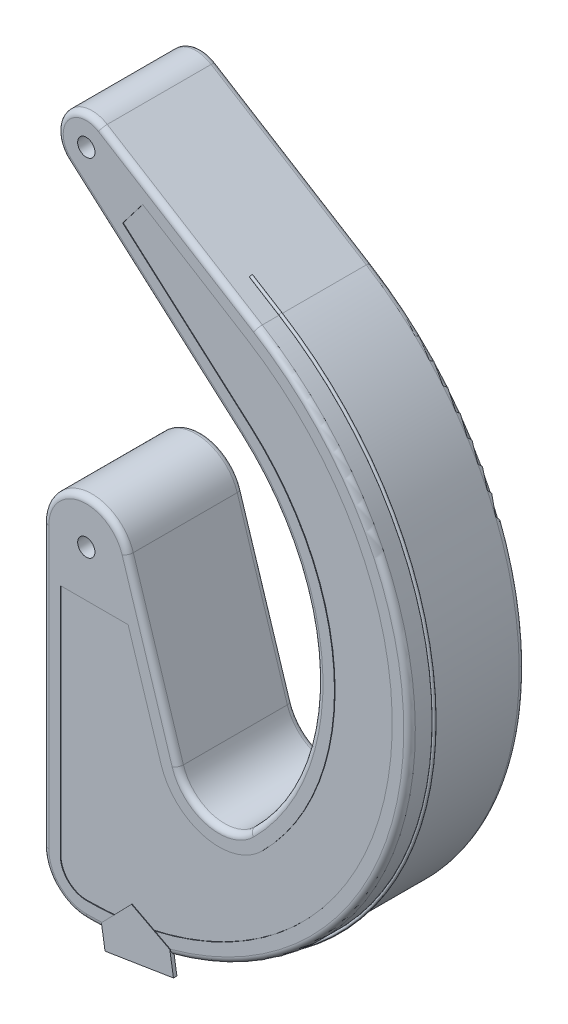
from build123d import *

# Parameters (mm, degrees)
ESQUISSE1_R             = 1.5
BOSS_EXTRU_1_DEPTH      = 10
CONG_1_R                = 1
BOSS_EXTRU_2_DEPTH      = 0.1
BOSS_EXTRU_2_DEPTH_BACK = 0.5
ENL_V_MAT_EXTRU_2_DEPTH = 0.1
ESQUISSE5_W             = 12
ESQUISSE5_H             = 38
ENL_V_MAT_EXTRU_3_DEPTH = 10
ESQUISSE6_R             = 1
BOSS_EXTRU_3_DEPTH      = 12
ESQUISSE9_R             = 0.25
ESQUISSE11_R            = 0.25


with BuildPart() as part:
    # Esquisse1 → Boss.-Extru.1 (new, symmetric)
    with BuildSketch(Plane.XY):
        with BuildLine():
            Line((-7.5, 0), (-7.5, -48.5))
            ThreePointArc((-7.5, -48.5), (-5.303300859, -53.803300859), (0, -56))
            ThreePointArc((0, -56), (53.859075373, -15.33623161), (29.499830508, 47.6))
            Line((29.499830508, 47.6), (2.633913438, 64.25))
            ThreePointArc((2.633913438, 64.25), (-4.014140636, 62.981052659), (-3.307189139, 56.25))
            Line((-3.307189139, 56.25), (26.457513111, 30))
            ThreePointArc((26.457513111, 30), (39.980367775, 1.253073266), (28.284271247, -28.284271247))
            ThreePointArc((28.284271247, -28.284271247), (21.199189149, -30.266247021), (15.828627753, -25.237958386))
            Line((15.828627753, -25.237958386), (7.152342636, 2.256987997))
            ThreePointArc((7.152342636, 2.256987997), (-1.141803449, 7.41257613), (-7.5, 0))
        make_face()
        with Locations((0, 60)):
            Circle(ESQUISSE1_R, mode=Mode.SUBTRACT)
        Circle(ESQUISSE1_R, mode=Mode.SUBTRACT)
    extrude(amount=BOSS_EXTRU_1_DEPTH, both=True)

    # Cong_1
    cong_1_edges = [part.edges().sort_by_distance(p)[0] for p in [
        (-4.014140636, 62.981052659, 10),
        (-1.141803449, 7.41257613, -10),
        (11.490485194, -11.490485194, -10),
        (21.199189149, -30.266247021, -10),
        (39.980367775, 1.253073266, -10),
        (11.575161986, 43.125, -10),
        (-4.014140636, 62.981052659, -10),
        (16.066871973, 55.925, -10),
        (53.859075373, -15.33623161, -10),
        (11.575161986, 43.125, 10),
        (39.980367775, 1.253073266, 10),
        (21.199189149, -30.266247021, 10),
        (11.490485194, -11.490485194, 10),
        (-1.141803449, 7.41257613, 10),
        (-7.5, -24.25, 10),
        (-5.303300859, -53.803300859, 10),
        (53.859075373, -15.33623161, 10),
        (16.066871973, 55.925, 10),
        (-5.303300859, -53.803300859, -10),
        (-7.5, -24.25, -10),
    ]]
    fillet(cong_1_edges, radius=CONG_1_R)

    # Esquisse2 → Boss.-Extru.2 (add, two sides: drawn at the far end of the back side and taken through both)
    with BuildSketch(Plane.XY.offset(10).offset(-BOSS_EXTRU_2_DEPTH_BACK)):
        Polygon((14.56616208, -53.036090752), (15.198414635, -56.985806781), (3.349266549, -58.882564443), (2.717013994, -54.932848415), (7.933336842, -49.559985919), align=None)
    extrude(amount=BOSS_EXTRU_2_DEPTH + BOSS_EXTRU_2_DEPTH_BACK)

    # Esquisse4 → Enl_v. mat.-Extru.2 (cut)
    with BuildSketch(Plane(origin=(0, 0, -10), x_dir=(-1, 0, 0), z_dir=(0, 0, -1))):
        with BuildLine():
            Line((-7.243207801, -8), (4.5, -8))
            Line((4.5, -8), (4.5, -48.5))
            ThreePointArc((4.5, -48.5), (3.181980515, -51.681980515), (0, -53))
            ThreePointArc((0, -53), (-50.973767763, -14.514647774), (-27.919482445, 45.05))
            Line((-27.919482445, 45.05), (-9.762493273, 56.302691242))
            Line((-9.762493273, 56.302691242), (-6.299907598, 51.777337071))
            Line((-6.299907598, 51.777337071), (-28.441826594, 32.25))
            ThreePointArc((-28.441826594, 32.25), (-42.978895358, 1.347053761), (-30.405591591, -30.405591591))
            ThreePointArc((-30.405591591, -30.405591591), (-20.486476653, -33.180357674), (-12.967690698, -26.140753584))
            Line((-12.967690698, -26.140753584), (-7.243207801, -8))
        make_face()
    enl_v_mat_extru_2 = extrude(amount=-ENL_V_MAT_EXTRU_2_DEPTH, mode=Mode.SUBTRACT)

    # Sym_trie1: Enl_v. mat.-Extru.2 across plane
    add(enl_v_mat_extru_2.mirror(Plane.XY), mode=Mode.SUBTRACT)

    # Esquisse5 → Enl_v. mat.-Extru.3 (cut)
    with BuildSketch(Plane.ZY.offset(7.5)):
        with Locations((0, -24.5)):
            Rectangle(ESQUISSE5_W, ESQUISSE5_H)
    extrude(amount=-ENL_V_MAT_EXTRU_3_DEPTH, mode=Mode.SUBTRACT)

    # Esquisse6 → Boss.-Extru.3 (add)
    with BuildSketch(Plane.XY.offset(-6)):
        with Locations(Location((-3.5, -39.5, 0), (0, 0, 180))):
            Circle(ESQUISSE6_R)
    extrude(amount=BOSS_EXTRU_3_DEPTH)

    # Balayage1: sweep along a path in Esquisse7
    with BuildLine(Plane.ZY.offset(4)) as balayage1_path:
        ThreePointArc((0, -19.140027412), (-0.51763809, -19.071879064), (-1, -18.872078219))
        Line((-1, -18.872078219), (-7.476454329, -15.132895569))
    # Esquisse9 → Balayage1 (sweep)
    with BuildSketch(Plane.XY):
        with Locations((-4, -19.140027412)):
            Circle(ESQUISSE9_R)
    balayage1 = sweep(path=balayage1_path.line)

    # Sym_trie2: Balayage1 across Front Plane
    add(balayage1.mirror(Plane.XY))


with BuildPart() as body_2:
    # Balayage3: sweep along a path in Esquisse10
    with BuildLine(Plane(origin=(0, 0, 6), x_dir=(-1, 0, 0), z_dir=(0, 0, -1))) as balayage3_path:
        Line((7.75, -43.5), (7.75, -48.5))
        ThreePointArc((7.75, -48.5), (5.480077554, -53.980077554), (0, -56.25))
        ThreePointArc((0, -56.25), (-54.099517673, -15.40469693), (-29.63152618, 47.8125))
        Line((-29.63152618, 47.8125), (-24.53152618, 50.973196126))
    # Esquisse11 → Balayage3 (sweep)
    with BuildSketch(Plane(origin=(0, -43.5, 0), x_dir=(1, 0, 0), z_dir=(0, 1, 0))):
        with Locations((-7.75, -6)):
            Circle(ESQUISSE11_R)
    sweep(path=balayage3_path.line)


solid = Compound([part.part, body_2.part])
